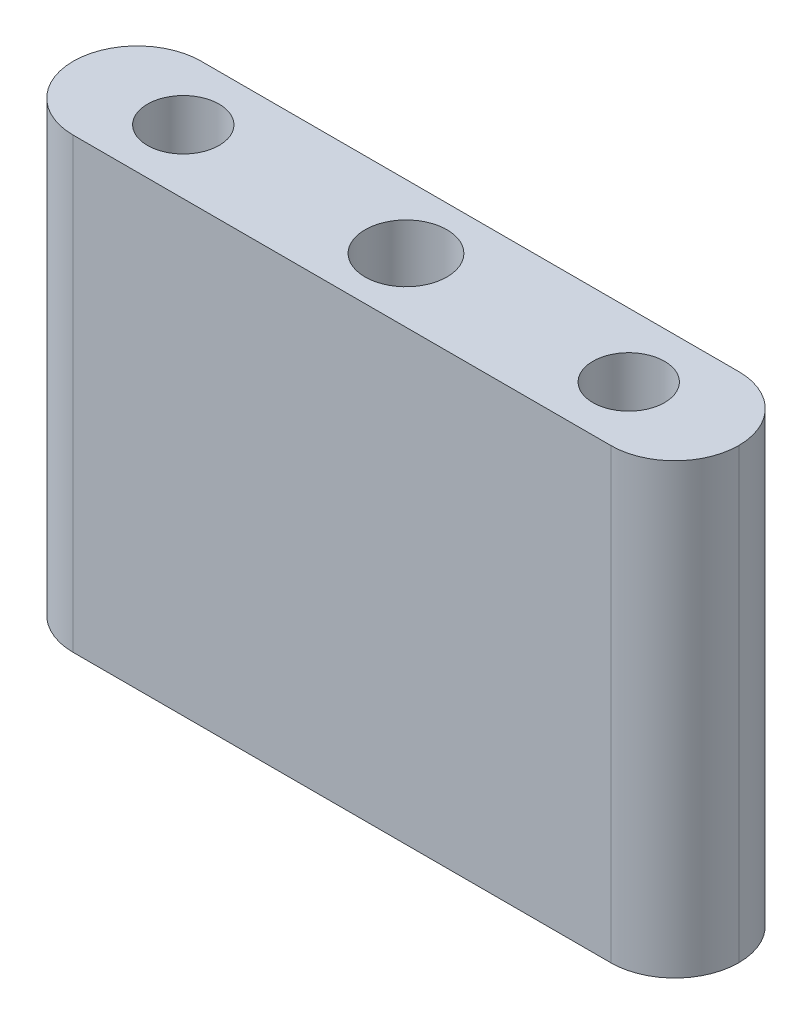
ISO-10303-21;
HEADER;
FILE_DESCRIPTION(('STEP AP214'),'2;1');
FILE_NAME('part.step','',(''),(''),'','','');
FILE_SCHEMA(('AUTOMOTIVE_DESIGN { 1 0 10303 214 1 1 1 1 }'));
ENDSEC;
DATA;
#1=APPLICATION_CONTEXT('core data for automotive mechanical design processes');
#2=APPLICATION_PROTOCOL_DEFINITION('international standard','automotive_design',2000,#1);
#3=PRODUCT_CONTEXT('',#1,'mechanical');
#4=PRODUCT('Part','Part','',(#3));
#5=PRODUCT_RELATED_PRODUCT_CATEGORY('part','',(#4));
#6=PRODUCT_DEFINITION_FORMATION('','',#4);
#7=PRODUCT_DEFINITION_CONTEXT('part definition',#1,'design');
#8=PRODUCT_DEFINITION('design','',#6,#7);
#9=PRODUCT_DEFINITION_SHAPE('','',#8);
#10=(LENGTH_UNIT() NAMED_UNIT(*) SI_UNIT(.MILLI.,.METRE.));
#11=(NAMED_UNIT(*) PLANE_ANGLE_UNIT() SI_UNIT($,.RADIAN.));
#12=(NAMED_UNIT(*) SI_UNIT($,.STERADIAN.) SOLID_ANGLE_UNIT());
#13=UNCERTAINTY_MEASURE_WITH_UNIT(LENGTH_MEASURE(1.E-05),#10,'distance_accuracy_value','');
#14=(GEOMETRIC_REPRESENTATION_CONTEXT(3) GLOBAL_UNCERTAINTY_ASSIGNED_CONTEXT((#13)) GLOBAL_UNIT_ASSIGNED_CONTEXT((#10,
#11,#12)) REPRESENTATION_CONTEXT('',''));
#15=CARTESIAN_POINT('',(0.,0.,0.));
#16=DIRECTION('',(0.,0.,1.));
#17=DIRECTION('',(1.,0.,0.));
#18=AXIS2_PLACEMENT_3D('',#15,#16,#17);
#19=CARTESIAN_POINT('',(0.,17.5,0.));
#20=DIRECTION('',(0.,1.,0.));
#21=DIRECTION('',(0.,0.,1.));
#22=AXIS2_PLACEMENT_3D('',#19,#20,#21);
#23=PLANE('',#22);
#24=CARTESIAN_POINT('',(8.7,17.5,0.));
#25=DIRECTION('',(0.,1.,0.));
#26=DIRECTION('',(0.,0.,-1.));
#27=AXIS2_PLACEMENT_3D('',#24,#25,#26);
#28=CIRCLE('',#27,1.4);
#29=CARTESIAN_POINT('',(8.7,17.5,-1.4));
#30=VERTEX_POINT('',#29);
#31=EDGE_CURVE('E154',#30,#30,#28,.T.);
#32=ORIENTED_EDGE('',*,*,#31,.F.);
#33=EDGE_LOOP('',(#32));
#34=FACE_BOUND('',#33,.T.);
#35=CARTESIAN_POINT('',(10.5,17.5,0.));
#36=DIRECTION('',(0.,1.,0.));
#37=DIRECTION('',(0.,0.,1.));
#38=AXIS2_PLACEMENT_3D('',#35,#36,#37);
#39=CIRCLE('',#38,2.5);
#40=CARTESIAN_POINT('',(10.5,17.5,2.5));
#41=VERTEX_POINT('',#40);
#42=CARTESIAN_POINT('',(13.,17.5,0.));
#43=VERTEX_POINT('',#42);
#44=EDGE_CURVE('E135',#41,#43,#39,.T.);
#45=ORIENTED_EDGE('',*,*,#44,.T.);
#46=CARTESIAN_POINT('',(10.5,17.5,0.));
#47=DIRECTION('',(0.,1.,0.));
#48=DIRECTION('',(0.,0.,1.));
#49=AXIS2_PLACEMENT_3D('',#46,#47,#48);
#50=CIRCLE('',#49,2.5);
#51=CARTESIAN_POINT('',(10.5,17.5,-2.5));
#52=VERTEX_POINT('',#51);
#53=EDGE_CURVE('E137',#43,#52,#50,.T.);
#54=ORIENTED_EDGE('',*,*,#53,.T.);
#55=DIRECTION('',(-1.,0.,0.));
#56=VECTOR('',#55,1.);
#57=CARTESIAN_POINT('',(-13.,17.5,-2.5));
#58=LINE('',#57,#56);
#59=CARTESIAN_POINT('',(-10.5,17.5,-2.5));
#60=VERTEX_POINT('',#59);
#61=EDGE_CURVE('E110',#52,#60,#58,.T.);
#62=ORIENTED_EDGE('',*,*,#61,.T.);
#63=CARTESIAN_POINT('',(-10.5,17.5,0.));
#64=DIRECTION('',(0.,1.,0.));
#65=DIRECTION('',(0.,0.,1.));
#66=AXIS2_PLACEMENT_3D('',#63,#64,#65);
#67=CIRCLE('',#66,2.5);
#68=CARTESIAN_POINT('',(-13.,17.5,0.));
#69=VERTEX_POINT('',#68);
#70=EDGE_CURVE('E100',#60,#69,#67,.T.);
#71=ORIENTED_EDGE('',*,*,#70,.T.);
#72=CARTESIAN_POINT('',(-10.5,17.5,0.));
#73=DIRECTION('',(0.,1.,0.));
#74=DIRECTION('',(0.,0.,1.));
#75=AXIS2_PLACEMENT_3D('',#72,#73,#74);
#76=CIRCLE('',#75,2.5);
#77=CARTESIAN_POINT('',(-10.5,17.5,2.5));
#78=VERTEX_POINT('',#77);
#79=EDGE_CURVE('E58',#69,#78,#76,.T.);
#80=ORIENTED_EDGE('',*,*,#79,.T.);
#81=DIRECTION('',(1.,0.,0.));
#82=VECTOR('',#81,1.);
#83=CARTESIAN_POINT('',(-13.,17.5,2.5));
#84=LINE('',#83,#82);
#85=EDGE_CURVE('E125',#78,#41,#84,.T.);
#86=ORIENTED_EDGE('',*,*,#85,.T.);
#87=EDGE_LOOP('',(#45,#54,#62,#71,#80,#86));
#88=FACE_BOUND('',#87,.T.);
#89=CARTESIAN_POINT('',(-8.7,17.5,0.));
#90=DIRECTION('',(0.,1.,0.));
#91=DIRECTION('',(0.,0.,1.));
#92=AXIS2_PLACEMENT_3D('',#89,#90,#91);
#93=CIRCLE('',#92,1.4);
#94=CARTESIAN_POINT('',(-8.7,17.5,1.4));
#95=VERTEX_POINT('',#94);
#96=EDGE_CURVE('E118',#95,#95,#93,.T.);
#97=ORIENTED_EDGE('',*,*,#96,.F.);
#98=EDGE_LOOP('',(#97));
#99=FACE_BOUND('',#98,.T.);
#100=CARTESIAN_POINT('',(0.,17.5,0.));
#101=DIRECTION('',(0.,1.,0.));
#102=DIRECTION('',(0.,0.,1.));
#103=AXIS2_PLACEMENT_3D('',#100,#101,#102);
#104=CIRCLE('',#103,1.6);
#105=CARTESIAN_POINT('',(0.,17.5,1.6));
#106=VERTEX_POINT('',#105);
#107=EDGE_CURVE('E142',#106,#106,#104,.T.);
#108=ORIENTED_EDGE('',*,*,#107,.F.);
#109=EDGE_LOOP('',(#108));
#110=FACE_BOUND('',#109,.T.);
#111=ADVANCED_FACE('F36',(#34,#88,#99,#110),#23,.T.);
#112=CARTESIAN_POINT('',(0.,0.,0.));
#113=DIRECTION('',(0.,1.,0.));
#114=DIRECTION('',(0.,0.,1.));
#115=AXIS2_PLACEMENT_3D('',#112,#113,#114);
#116=PLANE('',#115);
#117=DIRECTION('',(-1.,0.,0.));
#118=VECTOR('',#117,1.);
#119=CARTESIAN_POINT('',(-13.,0.,-2.5));
#120=LINE('',#119,#118);
#121=CARTESIAN_POINT('',(10.5,0.,-2.5));
#122=VERTEX_POINT('',#121);
#123=CARTESIAN_POINT('',(-10.5,0.,-2.5));
#124=VERTEX_POINT('',#123);
#125=EDGE_CURVE('E107',#122,#124,#120,.T.);
#126=ORIENTED_EDGE('',*,*,#125,.F.);
#127=CARTESIAN_POINT('',(10.5,0.,0.));
#128=DIRECTION('',(0.,1.,0.));
#129=DIRECTION('',(0.,0.,1.));
#130=AXIS2_PLACEMENT_3D('',#127,#128,#129);
#131=CIRCLE('',#130,2.5);
#132=CARTESIAN_POINT('',(13.,0.,0.));
#133=VERTEX_POINT('',#132);
#134=EDGE_CURVE('E90',#122,#133,#131,.F.);
#135=ORIENTED_EDGE('',*,*,#134,.T.);
#136=CARTESIAN_POINT('',(10.5,0.,0.));
#137=DIRECTION('',(0.,1.,0.));
#138=DIRECTION('',(0.,0.,1.));
#139=AXIS2_PLACEMENT_3D('',#136,#137,#138);
#140=CIRCLE('',#139,2.5);
#141=CARTESIAN_POINT('',(10.5,0.,2.5));
#142=VERTEX_POINT('',#141);
#143=EDGE_CURVE('E101',#133,#142,#140,.F.);
#144=ORIENTED_EDGE('',*,*,#143,.T.);
#145=DIRECTION('',(1.,0.,0.));
#146=VECTOR('',#145,1.);
#147=CARTESIAN_POINT('',(-13.,0.,2.5));
#148=LINE('',#147,#146);
#149=CARTESIAN_POINT('',(-10.5,0.,2.5));
#150=VERTEX_POINT('',#149);
#151=EDGE_CURVE('E117',#150,#142,#148,.T.);
#152=ORIENTED_EDGE('',*,*,#151,.F.);
#153=CARTESIAN_POINT('',(-10.5,0.,0.));
#154=DIRECTION('',(0.,1.,0.));
#155=DIRECTION('',(0.,0.,1.));
#156=AXIS2_PLACEMENT_3D('',#153,#154,#155);
#157=CIRCLE('',#156,2.5);
#158=CARTESIAN_POINT('',(-13.,0.,0.));
#159=VERTEX_POINT('',#158);
#160=EDGE_CURVE('E130',#150,#159,#157,.F.);
#161=ORIENTED_EDGE('',*,*,#160,.T.);
#162=CARTESIAN_POINT('',(-10.5,0.,0.));
#163=DIRECTION('',(0.,1.,0.));
#164=DIRECTION('',(0.,0.,1.));
#165=AXIS2_PLACEMENT_3D('',#162,#163,#164);
#166=CIRCLE('',#165,2.5);
#167=EDGE_CURVE('E111',#159,#124,#166,.F.);
#168=ORIENTED_EDGE('',*,*,#167,.T.);
#169=EDGE_LOOP('',(#126,#135,#144,#152,#161,#168));
#170=FACE_BOUND('',#169,.T.);
#171=CARTESIAN_POINT('',(-8.7,0.,0.));
#172=DIRECTION('',(0.,1.,0.));
#173=DIRECTION('',(0.,0.,1.));
#174=AXIS2_PLACEMENT_3D('',#171,#172,#173);
#175=CIRCLE('',#174,1.4);
#176=CARTESIAN_POINT('',(-8.7,0.,1.4));
#177=VERTEX_POINT('',#176);
#178=EDGE_CURVE('E122',#177,#177,#175,.T.);
#179=ORIENTED_EDGE('',*,*,#178,.T.);
#180=EDGE_LOOP('',(#179));
#181=FACE_BOUND('',#180,.T.);
#182=CARTESIAN_POINT('',(8.7,0.,0.));
#183=DIRECTION('',(0.,1.,0.));
#184=DIRECTION('',(0.,0.,-1.));
#185=AXIS2_PLACEMENT_3D('',#182,#183,#184);
#186=CIRCLE('',#185,1.4);
#187=CARTESIAN_POINT('',(8.7,0.,-1.4));
#188=VERTEX_POINT('',#187);
#189=EDGE_CURVE('E156',#188,#188,#186,.T.);
#190=ORIENTED_EDGE('',*,*,#189,.T.);
#191=EDGE_LOOP('',(#190));
#192=FACE_BOUND('',#191,.T.);
#193=CARTESIAN_POINT('',(0.,0.,0.));
#194=DIRECTION('',(0.,1.,0.));
#195=DIRECTION('',(0.,0.,1.));
#196=AXIS2_PLACEMENT_3D('',#193,#194,#195);
#197=CIRCLE('',#196,1.6);
#198=CARTESIAN_POINT('',(0.,0.,1.6));
#199=VERTEX_POINT('',#198);
#200=EDGE_CURVE('E140',#199,#199,#197,.T.);
#201=ORIENTED_EDGE('',*,*,#200,.T.);
#202=EDGE_LOOP('',(#201));
#203=FACE_BOUND('',#202,.T.);
#204=ADVANCED_FACE('F114',(#170,#181,#192,#203),#116,.F.);
#205=CARTESIAN_POINT('',(-13.,17.5,-2.5));
#206=DIRECTION('',(0.,0.,1.));
#207=DIRECTION('',(1.,0.,0.));
#208=AXIS2_PLACEMENT_3D('',#205,#206,#207);
#209=PLANE('',#208);
#210=ORIENTED_EDGE('',*,*,#61,.F.);
#211=DIRECTION('',(0.,-1.,0.));
#212=VECTOR('',#211,1.);
#213=CARTESIAN_POINT('',(10.5,17.5,-2.5));
#214=LINE('',#213,#212);
#215=EDGE_CURVE('E94',#52,#122,#214,.T.);
#216=ORIENTED_EDGE('',*,*,#215,.T.);
#217=ORIENTED_EDGE('',*,*,#125,.T.);
#218=DIRECTION('',(0.,-1.,0.));
#219=VECTOR('',#218,1.);
#220=CARTESIAN_POINT('',(-10.5,17.5,-2.5));
#221=LINE('',#220,#219);
#222=EDGE_CURVE('E112',#124,#60,#221,.F.);
#223=ORIENTED_EDGE('',*,*,#222,.T.);
#224=EDGE_LOOP('',(#210,#216,#217,#223));
#225=FACE_BOUND('',#224,.T.);
#226=ADVANCED_FACE('F106',(#225),#209,.F.);
#227=CARTESIAN_POINT('',(-13.,17.5,2.5));
#228=DIRECTION('',(0.,0.,-1.));
#229=DIRECTION('',(-1.,0.,0.));
#230=AXIS2_PLACEMENT_3D('',#227,#228,#229);
#231=PLANE('',#230);
#232=ORIENTED_EDGE('',*,*,#151,.T.);
#233=DIRECTION('',(0.,-1.,0.));
#234=VECTOR('',#233,1.);
#235=CARTESIAN_POINT('',(10.5,17.5,2.5));
#236=LINE('',#235,#234);
#237=EDGE_CURVE('E11',#142,#41,#236,.F.);
#238=ORIENTED_EDGE('',*,*,#237,.T.);
#239=ORIENTED_EDGE('',*,*,#85,.F.);
#240=DIRECTION('',(0.,-1.,0.));
#241=VECTOR('',#240,1.);
#242=CARTESIAN_POINT('',(-10.5,17.5,2.5));
#243=LINE('',#242,#241);
#244=EDGE_CURVE('E45',#78,#150,#243,.T.);
#245=ORIENTED_EDGE('',*,*,#244,.T.);
#246=EDGE_LOOP('',(#232,#238,#239,#245));
#247=FACE_BOUND('',#246,.T.);
#248=ADVANCED_FACE('F179',(#247),#231,.F.);
#249=CARTESIAN_POINT('',(-8.7,17.5,0.));
#250=DIRECTION('',(0.,-1.,0.));
#251=DIRECTION('',(0.,0.,-1.));
#252=AXIS2_PLACEMENT_3D('',#249,#250,#251);
#253=CYLINDRICAL_SURFACE('',#252,1.4);
#254=ORIENTED_EDGE('',*,*,#96,.T.);
#255=EDGE_LOOP('',(#254));
#256=FACE_BOUND('',#255,.T.);
#257=ORIENTED_EDGE('',*,*,#178,.F.);
#258=EDGE_LOOP('',(#257));
#259=FACE_BOUND('',#258,.T.);
#260=ADVANCED_FACE('F176',(#256,#259),#253,.F.);
#261=CARTESIAN_POINT('',(8.7,17.5,0.));
#262=DIRECTION('',(0.,-1.,0.));
#263=DIRECTION('',(0.,0.,-1.));
#264=AXIS2_PLACEMENT_3D('',#261,#262,#263);
#265=CYLINDRICAL_SURFACE('',#264,1.4);
#266=ORIENTED_EDGE('',*,*,#31,.T.);
#267=EDGE_LOOP('',(#266));
#268=FACE_BOUND('',#267,.T.);
#269=ORIENTED_EDGE('',*,*,#189,.F.);
#270=EDGE_LOOP('',(#269));
#271=FACE_BOUND('',#270,.T.);
#272=ADVANCED_FACE('F210',(#268,#271),#265,.F.);
#273=CARTESIAN_POINT('',(0.,17.5,0.));
#274=DIRECTION('',(0.,-1.,0.));
#275=DIRECTION('',(0.,0.,-1.));
#276=AXIS2_PLACEMENT_3D('',#273,#274,#275);
#277=CYLINDRICAL_SURFACE('',#276,1.6);
#278=ORIENTED_EDGE('',*,*,#107,.T.);
#279=EDGE_LOOP('',(#278));
#280=FACE_BOUND('',#279,.T.);
#281=ORIENTED_EDGE('',*,*,#200,.F.);
#282=EDGE_LOOP('',(#281));
#283=FACE_BOUND('',#282,.T.);
#284=ADVANCED_FACE('F164',(#280,#283),#277,.F.);
#285=CARTESIAN_POINT('',(10.5,17.5,0.));
#286=DIRECTION('',(0.,-1.,0.));
#287=DIRECTION('',(0.,0.,-1.));
#288=AXIS2_PLACEMENT_3D('',#285,#286,#287);
#289=CYLINDRICAL_SURFACE('',#288,2.5);
#290=DIRECTION('',(0.,-1.,0.));
#291=VECTOR('',#290,1.);
#292=CARTESIAN_POINT('',(13.,17.5,0.));
#293=LINE('',#292,#291);
#294=EDGE_CURVE('E96',#43,#133,#293,.T.);
#295=ORIENTED_EDGE('',*,*,#294,.F.);
#296=ORIENTED_EDGE('',*,*,#44,.F.);
#297=ORIENTED_EDGE('',*,*,#237,.F.);
#298=ORIENTED_EDGE('',*,*,#143,.F.);
#299=EDGE_LOOP('',(#295,#296,#297,#298));
#300=FACE_BOUND('',#299,.T.);
#301=ADVANCED_FACE('F186',(#300),#289,.T.);
#302=CARTESIAN_POINT('',(10.5,17.5,0.));
#303=DIRECTION('',(0.,-1.,0.));
#304=DIRECTION('',(0.,0.,-1.));
#305=AXIS2_PLACEMENT_3D('',#302,#303,#304);
#306=CYLINDRICAL_SURFACE('',#305,2.5);
#307=ORIENTED_EDGE('',*,*,#53,.F.);
#308=ORIENTED_EDGE('',*,*,#294,.T.);
#309=ORIENTED_EDGE('',*,*,#134,.F.);
#310=ORIENTED_EDGE('',*,*,#215,.F.);
#311=EDGE_LOOP('',(#307,#308,#309,#310));
#312=FACE_BOUND('',#311,.T.);
#313=ADVANCED_FACE('F93',(#312),#306,.T.);
#314=CARTESIAN_POINT('',(-10.5,17.5,0.));
#315=DIRECTION('',(0.,-1.,0.));
#316=DIRECTION('',(0.,0.,-1.));
#317=AXIS2_PLACEMENT_3D('',#314,#315,#316);
#318=CYLINDRICAL_SURFACE('',#317,2.5);
#319=DIRECTION('',(0.,-1.,0.));
#320=VECTOR('',#319,1.);
#321=CARTESIAN_POINT('',(-13.,17.5,0.));
#322=LINE('',#321,#320);
#323=EDGE_CURVE('E40',#69,#159,#322,.T.);
#324=ORIENTED_EDGE('',*,*,#323,.F.);
#325=ORIENTED_EDGE('',*,*,#70,.F.);
#326=ORIENTED_EDGE('',*,*,#222,.F.);
#327=ORIENTED_EDGE('',*,*,#167,.F.);
#328=EDGE_LOOP('',(#324,#325,#326,#327));
#329=FACE_BOUND('',#328,.T.);
#330=ADVANCED_FACE('F38',(#329),#318,.T.);
#331=CARTESIAN_POINT('',(-10.5,17.5,0.));
#332=DIRECTION('',(0.,-1.,0.));
#333=DIRECTION('',(0.,0.,-1.));
#334=AXIS2_PLACEMENT_3D('',#331,#332,#333);
#335=CYLINDRICAL_SURFACE('',#334,2.5);
#336=ORIENTED_EDGE('',*,*,#79,.F.);
#337=ORIENTED_EDGE('',*,*,#323,.T.);
#338=ORIENTED_EDGE('',*,*,#160,.F.);
#339=ORIENTED_EDGE('',*,*,#244,.F.);
#340=EDGE_LOOP('',(#336,#337,#338,#339));
#341=FACE_BOUND('',#340,.T.);
#342=ADVANCED_FACE('F147',(#341),#335,.T.);
#343=CLOSED_SHELL('',(#111,#204,#226,#248,#260,#272,#284,#301,#313,#330,#342));
#344=MANIFOLD_SOLID_BREP('B2',#343);
#345=ADVANCED_BREP_SHAPE_REPRESENTATION('',(#18,#344),#14);
#346=SHAPE_DEFINITION_REPRESENTATION(#9,#345);
ENDSEC;
END-ISO-10303-21;
